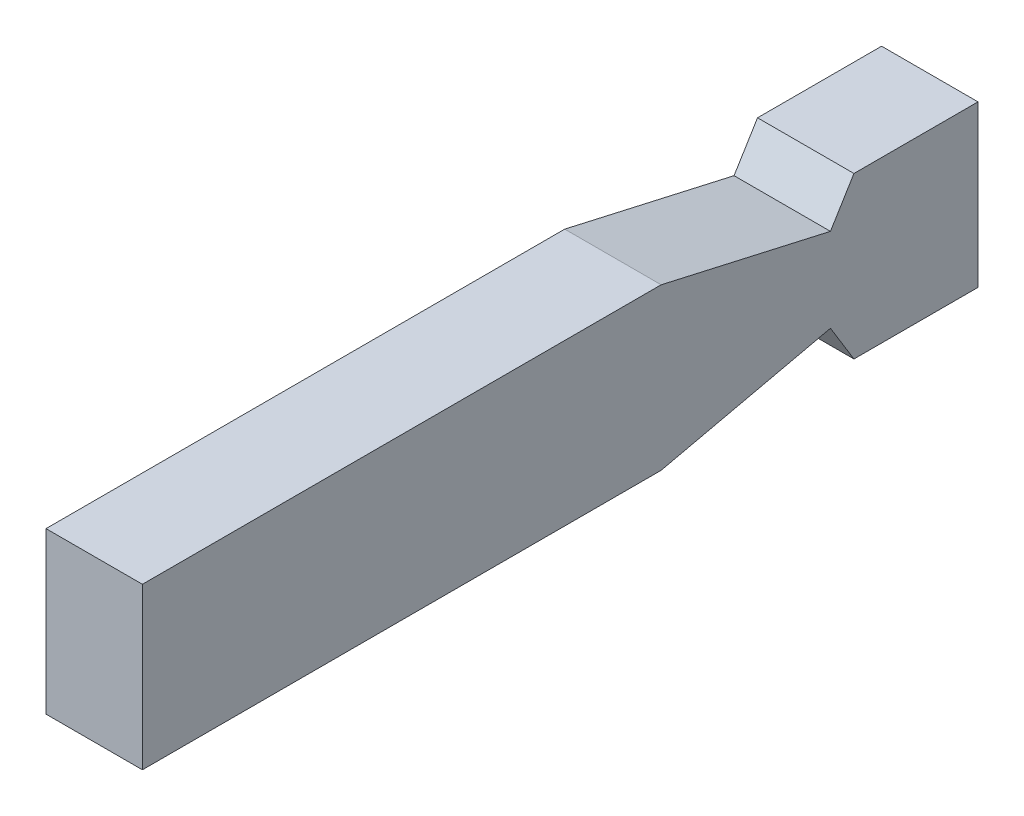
from build123d import *

# Parameters (mm, degrees)
ESQUISSE1_W             = 15
ESQUISSE1_H             = 25
EXTRUSION1_DEPTH        = 130
ENL_V_MAT_EXTRU_1_DEPTH = 134.229125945


with BuildPart() as part:
    # Esquisse1 → Extrusion1 (new body)
    with BuildSketch(Plane.XY):
        with Locations((7.5, 12.5)):
            Rectangle(ESQUISSE1_W, ESQUISSE1_H)
    extrude(amount=EXTRUSION1_DEPTH)

    # Esquisse4 → Enl_v. mat.-Extru.1 (cut, through all)
    with BuildSketch(Plane.ZY):
        Polygon((49.3, 25), (19.3, 25), (22.954251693, 19.029535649), align=None)
        Polygon((19.3, 0), (22.954251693, 5.970464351), (49.3, 0), align=None)
    extrude(amount=-ENL_V_MAT_EXTRU_1_DEPTH, mode=Mode.SUBTRACT)


solid = part.part
